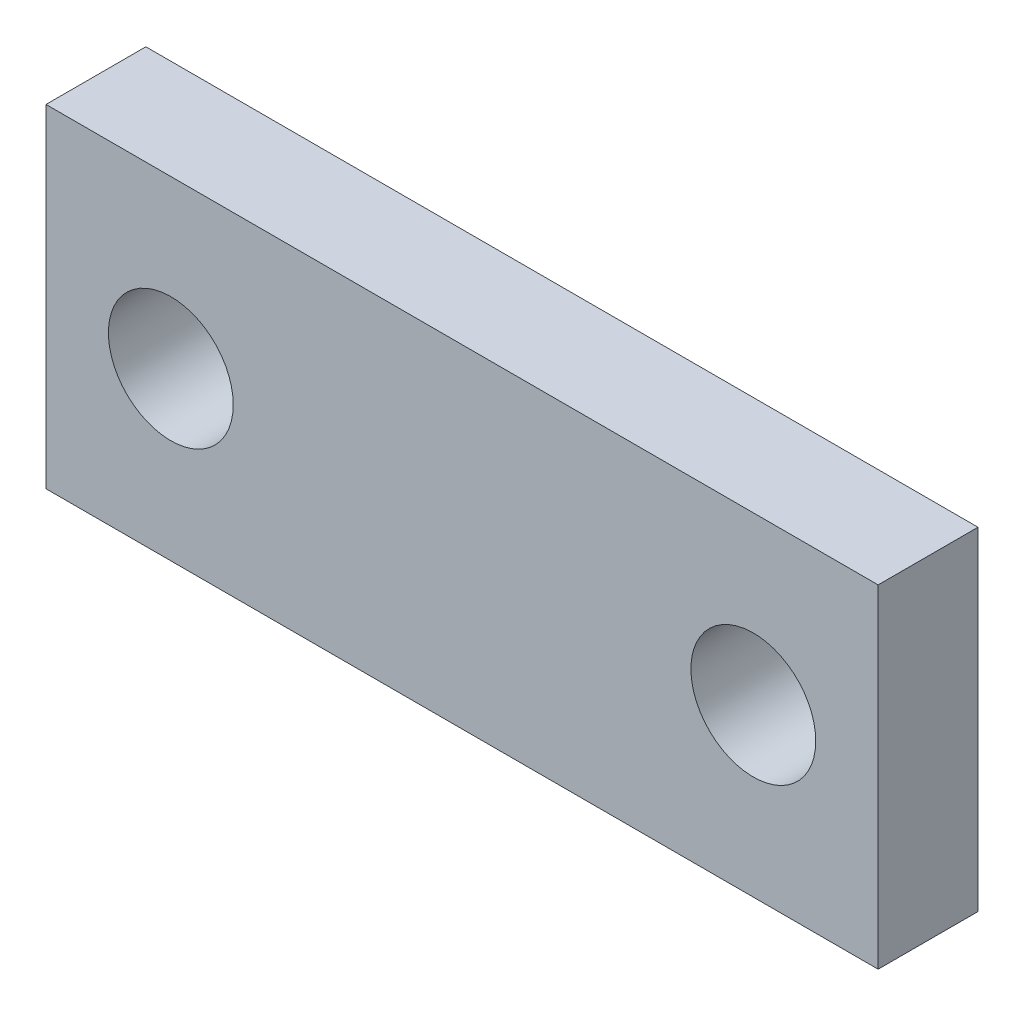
ISO-10303-21;
HEADER;
FILE_DESCRIPTION(('STEP AP214'),'2;1');
FILE_NAME('part.step','',(''),(''),'','','');
FILE_SCHEMA(('AUTOMOTIVE_DESIGN { 1 0 10303 214 1 1 1 1 }'));
ENDSEC;
DATA;
#1=APPLICATION_CONTEXT('core data for automotive mechanical design processes');
#2=APPLICATION_PROTOCOL_DEFINITION('international standard','automotive_design',2000,#1);
#3=PRODUCT_CONTEXT('',#1,'mechanical');
#4=PRODUCT('Part','Part','',(#3));
#5=PRODUCT_RELATED_PRODUCT_CATEGORY('part','',(#4));
#6=PRODUCT_DEFINITION_FORMATION('','',#4);
#7=PRODUCT_DEFINITION_CONTEXT('part definition',#1,'design');
#8=PRODUCT_DEFINITION('design','',#6,#7);
#9=PRODUCT_DEFINITION_SHAPE('','',#8);
#10=(LENGTH_UNIT() NAMED_UNIT(*) SI_UNIT(.MILLI.,.METRE.));
#11=(NAMED_UNIT(*) PLANE_ANGLE_UNIT() SI_UNIT($,.RADIAN.));
#12=(NAMED_UNIT(*) SI_UNIT($,.STERADIAN.) SOLID_ANGLE_UNIT());
#13=UNCERTAINTY_MEASURE_WITH_UNIT(LENGTH_MEASURE(1.E-05),#10,'distance_accuracy_value','');
#14=(GEOMETRIC_REPRESENTATION_CONTEXT(3) GLOBAL_UNCERTAINTY_ASSIGNED_CONTEXT((#13)) GLOBAL_UNIT_ASSIGNED_CONTEXT((#10,
#11,#12)) REPRESENTATION_CONTEXT('',''));
#15=CARTESIAN_POINT('',(0.,0.,0.));
#16=DIRECTION('',(0.,0.,1.));
#17=DIRECTION('',(1.,0.,0.));
#18=AXIS2_PLACEMENT_3D('',#15,#16,#17);
#19=CARTESIAN_POINT('',(-19.9221030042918,3.27947067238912,3.81));
#20=DIRECTION('',(1.,0.,0.));
#21=DIRECTION('',(0.,0.,-1.));
#22=AXIS2_PLACEMENT_3D('',#19,#20,#21);
#23=PLANE('',#22);
#24=DIRECTION('',(0.,-1.,0.));
#25=VECTOR('',#24,1.);
#26=CARTESIAN_POINT('',(-19.9221030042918,3.27947067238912,0.));
#27=LINE('',#26,#25);
#28=CARTESIAN_POINT('',(-19.9221030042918,3.27947067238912,0.));
#29=VERTEX_POINT('',#28);
#30=CARTESIAN_POINT('',(-19.9221030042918,-9.42052932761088,0.));
#31=VERTEX_POINT('',#30);
#32=EDGE_CURVE('E75',#29,#31,#27,.T.);
#33=ORIENTED_EDGE('',*,*,#32,.T.);
#34=DIRECTION('',(0.,0.,-1.));
#35=VECTOR('',#34,1.);
#36=CARTESIAN_POINT('',(-19.9221030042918,-9.42052932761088,3.81));
#37=LINE('',#36,#35);
#38=CARTESIAN_POINT('',(-19.9221030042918,-9.42052932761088,3.81));
#39=VERTEX_POINT('',#38);
#40=EDGE_CURVE('E11',#39,#31,#37,.T.);
#41=ORIENTED_EDGE('',*,*,#40,.F.);
#42=DIRECTION('',(0.,-1.,0.));
#43=VECTOR('',#42,1.);
#44=CARTESIAN_POINT('',(-19.9221030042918,3.27947067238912,3.81));
#45=LINE('',#44,#43);
#46=CARTESIAN_POINT('',(-19.9221030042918,3.27947067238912,3.81));
#47=VERTEX_POINT('',#46);
#48=EDGE_CURVE('E98',#47,#39,#45,.T.);
#49=ORIENTED_EDGE('',*,*,#48,.F.);
#50=DIRECTION('',(0.,0.,-1.));
#51=VECTOR('',#50,1.);
#52=CARTESIAN_POINT('',(-19.9221030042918,3.27947067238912,3.81));
#53=LINE('',#52,#51);
#54=EDGE_CURVE('E87',#47,#29,#53,.T.);
#55=ORIENTED_EDGE('',*,*,#54,.T.);
#56=EDGE_LOOP('',(#33,#41,#49,#55));
#57=FACE_BOUND('',#56,.T.);
#58=ADVANCED_FACE('F31',(#57),#23,.F.);
#59=CARTESIAN_POINT('',(-19.9221030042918,-9.42052932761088,3.81));
#60=DIRECTION('',(0.,1.,0.));
#61=DIRECTION('',(0.,0.,1.));
#62=AXIS2_PLACEMENT_3D('',#59,#60,#61);
#63=PLANE('',#62);
#64=DIRECTION('',(1.,0.,0.));
#65=VECTOR('',#64,1.);
#66=CARTESIAN_POINT('',(-19.9221030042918,-9.42052932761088,0.));
#67=LINE('',#66,#65);
#68=CARTESIAN_POINT('',(11.8278969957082,-9.42052932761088,0.));
#69=VERTEX_POINT('',#68);
#70=EDGE_CURVE('E71',#31,#69,#67,.T.);
#71=ORIENTED_EDGE('',*,*,#70,.T.);
#72=DIRECTION('',(0.,0.,-1.));
#73=VECTOR('',#72,1.);
#74=CARTESIAN_POINT('',(11.8278969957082,-9.42052932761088,3.81));
#75=LINE('',#74,#73);
#76=CARTESIAN_POINT('',(11.8278969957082,-9.42052932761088,3.81));
#77=VERTEX_POINT('',#76);
#78=EDGE_CURVE('E38',#77,#69,#75,.T.);
#79=ORIENTED_EDGE('',*,*,#78,.F.);
#80=DIRECTION('',(1.,0.,0.));
#81=VECTOR('',#80,1.);
#82=CARTESIAN_POINT('',(-19.9221030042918,-9.42052932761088,3.81));
#83=LINE('',#82,#81);
#84=EDGE_CURVE('E83',#39,#77,#83,.T.);
#85=ORIENTED_EDGE('',*,*,#84,.F.);
#86=ORIENTED_EDGE('',*,*,#40,.T.);
#87=EDGE_LOOP('',(#71,#79,#85,#86));
#88=FACE_BOUND('',#87,.T.);
#89=ADVANCED_FACE('F82',(#88),#63,.F.);
#90=CARTESIAN_POINT('',(11.8278969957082,3.27947067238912,3.81));
#91=DIRECTION('',(-1.,0.,0.));
#92=DIRECTION('',(0.,0.,1.));
#93=AXIS2_PLACEMENT_3D('',#90,#91,#92);
#94=PLANE('',#93);
#95=DIRECTION('',(0.,1.,0.));
#96=VECTOR('',#95,1.);
#97=CARTESIAN_POINT('',(11.8278969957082,3.27947067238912,0.));
#98=LINE('',#97,#96);
#99=CARTESIAN_POINT('',(11.8278969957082,3.27947067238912,0.));
#100=VERTEX_POINT('',#99);
#101=EDGE_CURVE('E76',#69,#100,#98,.T.);
#102=ORIENTED_EDGE('',*,*,#101,.T.);
#103=DIRECTION('',(0.,0.,-1.));
#104=VECTOR('',#103,1.);
#105=CARTESIAN_POINT('',(11.8278969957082,3.27947067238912,3.81));
#106=LINE('',#105,#104);
#107=CARTESIAN_POINT('',(11.8278969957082,3.27947067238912,3.81));
#108=VERTEX_POINT('',#107);
#109=EDGE_CURVE('E104',#108,#100,#106,.T.);
#110=ORIENTED_EDGE('',*,*,#109,.F.);
#111=DIRECTION('',(0.,1.,0.));
#112=VECTOR('',#111,1.);
#113=CARTESIAN_POINT('',(11.8278969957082,3.27947067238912,3.81));
#114=LINE('',#113,#112);
#115=EDGE_CURVE('E50',#77,#108,#114,.T.);
#116=ORIENTED_EDGE('',*,*,#115,.F.);
#117=ORIENTED_EDGE('',*,*,#78,.T.);
#118=EDGE_LOOP('',(#102,#110,#116,#117));
#119=FACE_BOUND('',#118,.T.);
#120=ADVANCED_FACE('F107',(#119),#94,.F.);
#121=CARTESIAN_POINT('',(-19.9221030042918,3.27947067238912,3.81));
#122=DIRECTION('',(0.,-1.,0.));
#123=DIRECTION('',(0.,0.,-1.));
#124=AXIS2_PLACEMENT_3D('',#121,#122,#123);
#125=PLANE('',#124);
#126=DIRECTION('',(-1.,0.,0.));
#127=VECTOR('',#126,1.);
#128=CARTESIAN_POINT('',(-19.9221030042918,3.27947067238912,0.));
#129=LINE('',#128,#127);
#130=EDGE_CURVE('E96',#100,#29,#129,.T.);
#131=ORIENTED_EDGE('',*,*,#130,.T.);
#132=ORIENTED_EDGE('',*,*,#54,.F.);
#133=DIRECTION('',(-1.,0.,0.));
#134=VECTOR('',#133,1.);
#135=CARTESIAN_POINT('',(-19.9221030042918,3.27947067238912,3.81));
#136=LINE('',#135,#134);
#137=EDGE_CURVE('E45',#108,#47,#136,.T.);
#138=ORIENTED_EDGE('',*,*,#137,.F.);
#139=ORIENTED_EDGE('',*,*,#109,.T.);
#140=EDGE_LOOP('',(#131,#132,#138,#139));
#141=FACE_BOUND('',#140,.T.);
#142=ADVANCED_FACE('F109',(#141),#125,.F.);
#143=CARTESIAN_POINT('',(-19.9221030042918,-9.42052932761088,3.81));
#144=DIRECTION('',(0.,0.,1.));
#145=DIRECTION('',(1.,0.,0.));
#146=AXIS2_PLACEMENT_3D('',#143,#144,#145);
#147=PLANE('',#146);
#148=CARTESIAN_POINT('',(7.06539699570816,-3.07052932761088,3.81));
#149=DIRECTION('',(0.,0.,1.));
#150=DIRECTION('',(-1.,0.,0.));
#151=AXIS2_PLACEMENT_3D('',#148,#149,#150);
#152=CIRCLE('',#151,2.38125);
#153=CARTESIAN_POINT('',(9.44664699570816,-3.07052932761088,3.81));
#154=VERTEX_POINT('',#153);
#155=EDGE_CURVE('E176',#154,#154,#152,.T.);
#156=ORIENTED_EDGE('',*,*,#155,.F.);
#157=EDGE_LOOP('',(#156));
#158=FACE_BOUND('',#157,.T.);
#159=CARTESIAN_POINT('',(-15.1596030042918,-3.07052932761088,3.81));
#160=DIRECTION('',(0.,0.,1.));
#161=DIRECTION('',(1.,0.,0.));
#162=AXIS2_PLACEMENT_3D('',#159,#160,#161);
#163=CIRCLE('',#162,2.38125);
#164=CARTESIAN_POINT('',(-12.7783530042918,-3.07052932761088,3.81));
#165=VERTEX_POINT('',#164);
#166=EDGE_CURVE('E91',#165,#165,#163,.T.);
#167=ORIENTED_EDGE('',*,*,#166,.F.);
#168=EDGE_LOOP('',(#167));
#169=FACE_BOUND('',#168,.T.);
#170=ORIENTED_EDGE('',*,*,#48,.T.);
#171=ORIENTED_EDGE('',*,*,#84,.T.);
#172=ORIENTED_EDGE('',*,*,#115,.T.);
#173=ORIENTED_EDGE('',*,*,#137,.T.);
#174=EDGE_LOOP('',(#170,#171,#172,#173));
#175=FACE_BOUND('',#174,.T.);
#176=ADVANCED_FACE('F110',(#158,#169,#175),#147,.T.);
#177=CARTESIAN_POINT('',(-19.9221030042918,-9.42052932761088,0.));
#178=DIRECTION('',(0.,0.,1.));
#179=DIRECTION('',(1.,0.,0.));
#180=AXIS2_PLACEMENT_3D('',#177,#178,#179);
#181=PLANE('',#180);
#182=CARTESIAN_POINT('',(7.06539699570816,-3.07052932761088,0.));
#183=DIRECTION('',(0.,0.,1.));
#184=DIRECTION('',(-1.,0.,0.));
#185=AXIS2_PLACEMENT_3D('',#182,#183,#184);
#186=CIRCLE('',#185,2.38125);
#187=CARTESIAN_POINT('',(9.44664699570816,-3.07052932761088,0.));
#188=VERTEX_POINT('',#187);
#189=EDGE_CURVE('E174',#188,#188,#186,.T.);
#190=ORIENTED_EDGE('',*,*,#189,.T.);
#191=EDGE_LOOP('',(#190));
#192=FACE_BOUND('',#191,.T.);
#193=CARTESIAN_POINT('',(-15.1596030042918,-3.07052932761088,0.));
#194=DIRECTION('',(0.,0.,1.));
#195=DIRECTION('',(1.,0.,0.));
#196=AXIS2_PLACEMENT_3D('',#193,#194,#195);
#197=CIRCLE('',#196,2.38125);
#198=CARTESIAN_POINT('',(-12.7783530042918,-3.07052932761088,0.));
#199=VERTEX_POINT('',#198);
#200=EDGE_CURVE('E88',#199,#199,#197,.T.);
#201=ORIENTED_EDGE('',*,*,#200,.T.);
#202=EDGE_LOOP('',(#201));
#203=FACE_BOUND('',#202,.T.);
#204=ORIENTED_EDGE('',*,*,#32,.F.);
#205=ORIENTED_EDGE('',*,*,#130,.F.);
#206=ORIENTED_EDGE('',*,*,#101,.F.);
#207=ORIENTED_EDGE('',*,*,#70,.F.);
#208=EDGE_LOOP('',(#204,#205,#206,#207));
#209=FACE_BOUND('',#208,.T.);
#210=ADVANCED_FACE('F72',(#192,#203,#209),#181,.F.);
#211=CARTESIAN_POINT('',(-15.1596030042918,-3.07052932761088,0.));
#212=DIRECTION('',(0.,0.,1.));
#213=DIRECTION('',(1.,0.,0.));
#214=AXIS2_PLACEMENT_3D('',#211,#212,#213);
#215=CYLINDRICAL_SURFACE('',#214,2.38125);
#216=CARTESIAN_POINT('',(-12.7783530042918,-3.07052932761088,0.));
#217=CARTESIAN_POINT('',(-12.7783530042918,-3.07052932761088,0.0396874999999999));
#218=CARTESIAN_POINT('',(-12.7783530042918,-3.07052932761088,0.079375));
#219=CARTESIAN_POINT('',(-12.7783530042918,-3.07052932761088,0.15875));
#220=CARTESIAN_POINT('',(-12.7783530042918,-3.07052932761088,0.1984375));
#221=CARTESIAN_POINT('',(-12.7783530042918,-3.07052932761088,0.2778125));
#222=CARTESIAN_POINT('',(-12.7783530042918,-3.07052932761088,0.3175));
#223=CARTESIAN_POINT('',(-12.7783530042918,-3.07052932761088,0.396875));
#224=CARTESIAN_POINT('',(-12.7783530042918,-3.07052932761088,0.4365625));
#225=CARTESIAN_POINT('',(-12.7783530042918,-3.07052932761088,0.5159375));
#226=CARTESIAN_POINT('',(-12.7783530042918,-3.07052932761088,0.555625));
#227=CARTESIAN_POINT('',(-12.7783530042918,-3.07052932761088,0.635));
#228=CARTESIAN_POINT('',(-12.7783530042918,-3.07052932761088,0.6746875));
#229=CARTESIAN_POINT('',(-12.7783530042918,-3.07052932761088,0.7540625));
#230=CARTESIAN_POINT('',(-12.7783530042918,-3.07052932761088,0.79375));
#231=CARTESIAN_POINT('',(-12.7783530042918,-3.07052932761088,0.873125));
#232=CARTESIAN_POINT('',(-12.7783530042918,-3.07052932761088,0.9128125));
#233=CARTESIAN_POINT('',(-12.7783530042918,-3.07052932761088,0.9921875));
#234=CARTESIAN_POINT('',(-12.7783530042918,-3.07052932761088,1.031875));
#235=CARTESIAN_POINT('',(-12.7783530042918,-3.07052932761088,1.11125));
#236=CARTESIAN_POINT('',(-12.7783530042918,-3.07052932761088,1.1509375));
#237=CARTESIAN_POINT('',(-12.7783530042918,-3.07052932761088,1.2303125));
#238=CARTESIAN_POINT('',(-12.7783530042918,-3.07052932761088,1.27));
#239=CARTESIAN_POINT('',(-12.7783530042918,-3.07052932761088,1.349375));
#240=CARTESIAN_POINT('',(-12.7783530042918,-3.07052932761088,1.3890625));
#241=CARTESIAN_POINT('',(-12.7783530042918,-3.07052932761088,1.4684375));
#242=CARTESIAN_POINT('',(-12.7783530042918,-3.07052932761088,1.508125));
#243=CARTESIAN_POINT('',(-12.7783530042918,-3.07052932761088,1.5875));
#244=CARTESIAN_POINT('',(-12.7783530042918,-3.07052932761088,1.6271875));
#245=CARTESIAN_POINT('',(-12.7783530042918,-3.07052932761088,1.7065625));
#246=CARTESIAN_POINT('',(-12.7783530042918,-3.07052932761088,1.74625));
#247=CARTESIAN_POINT('',(-12.7783530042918,-3.07052932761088,1.825625));
#248=CARTESIAN_POINT('',(-12.7783530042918,-3.07052932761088,1.8653125));
#249=CARTESIAN_POINT('',(-12.7783530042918,-3.07052932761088,1.9446875));
#250=CARTESIAN_POINT('',(-12.7783530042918,-3.07052932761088,1.984375));
#251=CARTESIAN_POINT('',(-12.7783530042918,-3.07052932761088,2.06375));
#252=CARTESIAN_POINT('',(-12.7783530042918,-3.07052932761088,2.1034375));
#253=CARTESIAN_POINT('',(-12.7783530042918,-3.07052932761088,2.1828125));
#254=CARTESIAN_POINT('',(-12.7783530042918,-3.07052932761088,2.2225));
#255=CARTESIAN_POINT('',(-12.7783530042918,-3.07052932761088,2.301875));
#256=CARTESIAN_POINT('',(-12.7783530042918,-3.07052932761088,2.3415625));
#257=CARTESIAN_POINT('',(-12.7783530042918,-3.07052932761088,2.4209375));
#258=CARTESIAN_POINT('',(-12.7783530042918,-3.07052932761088,2.460625));
#259=CARTESIAN_POINT('',(-12.7783530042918,-3.07052932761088,2.54));
#260=CARTESIAN_POINT('',(-12.7783530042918,-3.07052932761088,2.5796875));
#261=CARTESIAN_POINT('',(-12.7783530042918,-3.07052932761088,2.6590625));
#262=CARTESIAN_POINT('',(-12.7783530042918,-3.07052932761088,2.69875));
#263=CARTESIAN_POINT('',(-12.7783530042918,-3.07052932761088,2.778125));
#264=CARTESIAN_POINT('',(-12.7783530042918,-3.07052932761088,2.8178125));
#265=CARTESIAN_POINT('',(-12.7783530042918,-3.07052932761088,2.8971875));
#266=CARTESIAN_POINT('',(-12.7783530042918,-3.07052932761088,2.936875));
#267=CARTESIAN_POINT('',(-12.7783530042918,-3.07052932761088,3.01625));
#268=CARTESIAN_POINT('',(-12.7783530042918,-3.07052932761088,3.0559375));
#269=CARTESIAN_POINT('',(-12.7783530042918,-3.07052932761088,3.1353125));
#270=CARTESIAN_POINT('',(-12.7783530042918,-3.07052932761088,3.175));
#271=CARTESIAN_POINT('',(-12.7783530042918,-3.07052932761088,3.254375));
#272=CARTESIAN_POINT('',(-12.7783530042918,-3.07052932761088,3.2940625));
#273=CARTESIAN_POINT('',(-12.7783530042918,-3.07052932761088,3.3734375));
#274=CARTESIAN_POINT('',(-12.7783530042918,-3.07052932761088,3.413125));
#275=CARTESIAN_POINT('',(-12.7783530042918,-3.07052932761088,3.4925));
#276=CARTESIAN_POINT('',(-12.7783530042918,-3.07052932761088,3.5321875));
#277=CARTESIAN_POINT('',(-12.7783530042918,-3.07052932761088,3.6115625));
#278=CARTESIAN_POINT('',(-12.7783530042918,-3.07052932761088,3.65125));
#279=CARTESIAN_POINT('',(-12.7783530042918,-3.07052932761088,3.730625));
#280=CARTESIAN_POINT('',(-12.7783530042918,-3.07052932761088,3.7703125));
#281=CARTESIAN_POINT('',(-12.7783530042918,-3.07052932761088,3.81));
#282=B_SPLINE_CURVE_WITH_KNOTS('',3,(#216,#217,#218,#219,#220,#221,#222,#223,#224,#225,#226,
#227,#228,#229,#230,#231,#232,#233,#234,#235,#236,#237,#238,#239,#240,#241,#242,#243,#244,#245,
#246,#247,#248,#249,#250,#251,#252,#253,#254,#255,#256,#257,#258,#259,#260,#261,#262,#263,#264,
#265,#266,#267,#268,#269,#270,#271,#272,#273,#274,#275,#276,#277,#278,#279,#280,#281),
.UNSPECIFIED.,.F.,.F.,(4,2,2,2,2,2,2,2,2,2,2,2,2,2,2,2,2,2,2,2,2,2,2,2,2,2,2,2,2,2,2,2,4),(0.,
0.1190625,0.238125,0.3571875,0.47625,0.5953125,0.714375,0.8334375,0.9525,1.0715625,1.190625,
1.3096875,1.42875,1.5478125,1.666875,1.7859375,1.905,2.0240625,2.143125,2.2621875,2.38125,
2.5003125,2.619375,2.7384375,2.8575,2.9765625,3.095625,3.2146875,3.33375,3.4528125,3.571875,
3.6909375,3.81),.UNSPECIFIED.);
#283=EDGE_CURVE('BSEAM118',#199,#165,#282,.T.);
#284=ORIENTED_EDGE('',*,*,#200,.F.);
#285=ORIENTED_EDGE('',*,*,#166,.T.);
#286=ORIENTED_EDGE('',*,*,#283,.T.);
#287=ORIENTED_EDGE('',*,*,#283,.F.);
#288=EDGE_LOOP('',(#284,#286,#285,#287));
#289=FACE_BOUND('',#288,.T.);
#290=ADVANCED_FACE('F118',(#289),#215,.F.);
#291=CARTESIAN_POINT('',(7.06539699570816,-3.07052932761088,0.));
#292=DIRECTION('',(0.,0.,1.));
#293=DIRECTION('',(1.,0.,0.));
#294=AXIS2_PLACEMENT_3D('',#291,#292,#293);
#295=CYLINDRICAL_SURFACE('',#294,2.38125);
#296=CARTESIAN_POINT('',(9.44664699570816,-3.07052932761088,0.));
#297=CARTESIAN_POINT('',(9.44664699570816,-3.07052932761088,0.0396874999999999));
#298=CARTESIAN_POINT('',(9.44664699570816,-3.07052932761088,0.079375));
#299=CARTESIAN_POINT('',(9.44664699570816,-3.07052932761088,0.15875));
#300=CARTESIAN_POINT('',(9.44664699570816,-3.07052932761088,0.1984375));
#301=CARTESIAN_POINT('',(9.44664699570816,-3.07052932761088,0.2778125));
#302=CARTESIAN_POINT('',(9.44664699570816,-3.07052932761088,0.3175));
#303=CARTESIAN_POINT('',(9.44664699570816,-3.07052932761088,0.396875));
#304=CARTESIAN_POINT('',(9.44664699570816,-3.07052932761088,0.4365625));
#305=CARTESIAN_POINT('',(9.44664699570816,-3.07052932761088,0.5159375));
#306=CARTESIAN_POINT('',(9.44664699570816,-3.07052932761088,0.555625));
#307=CARTESIAN_POINT('',(9.44664699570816,-3.07052932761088,0.635));
#308=CARTESIAN_POINT('',(9.44664699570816,-3.07052932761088,0.6746875));
#309=CARTESIAN_POINT('',(9.44664699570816,-3.07052932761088,0.7540625));
#310=CARTESIAN_POINT('',(9.44664699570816,-3.07052932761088,0.79375));
#311=CARTESIAN_POINT('',(9.44664699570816,-3.07052932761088,0.873125));
#312=CARTESIAN_POINT('',(9.44664699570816,-3.07052932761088,0.9128125));
#313=CARTESIAN_POINT('',(9.44664699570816,-3.07052932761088,0.9921875));
#314=CARTESIAN_POINT('',(9.44664699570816,-3.07052932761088,1.031875));
#315=CARTESIAN_POINT('',(9.44664699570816,-3.07052932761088,1.11125));
#316=CARTESIAN_POINT('',(9.44664699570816,-3.07052932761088,1.1509375));
#317=CARTESIAN_POINT('',(9.44664699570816,-3.07052932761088,1.2303125));
#318=CARTESIAN_POINT('',(9.44664699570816,-3.07052932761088,1.27));
#319=CARTESIAN_POINT('',(9.44664699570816,-3.07052932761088,1.349375));
#320=CARTESIAN_POINT('',(9.44664699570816,-3.07052932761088,1.3890625));
#321=CARTESIAN_POINT('',(9.44664699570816,-3.07052932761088,1.4684375));
#322=CARTESIAN_POINT('',(9.44664699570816,-3.07052932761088,1.508125));
#323=CARTESIAN_POINT('',(9.44664699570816,-3.07052932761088,1.5875));
#324=CARTESIAN_POINT('',(9.44664699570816,-3.07052932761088,1.6271875));
#325=CARTESIAN_POINT('',(9.44664699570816,-3.07052932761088,1.7065625));
#326=CARTESIAN_POINT('',(9.44664699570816,-3.07052932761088,1.74625));
#327=CARTESIAN_POINT('',(9.44664699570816,-3.07052932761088,1.825625));
#328=CARTESIAN_POINT('',(9.44664699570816,-3.07052932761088,1.8653125));
#329=CARTESIAN_POINT('',(9.44664699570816,-3.07052932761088,1.9446875));
#330=CARTESIAN_POINT('',(9.44664699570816,-3.07052932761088,1.984375));
#331=CARTESIAN_POINT('',(9.44664699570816,-3.07052932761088,2.06375));
#332=CARTESIAN_POINT('',(9.44664699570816,-3.07052932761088,2.1034375));
#333=CARTESIAN_POINT('',(9.44664699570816,-3.07052932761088,2.1828125));
#334=CARTESIAN_POINT('',(9.44664699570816,-3.07052932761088,2.2225));
#335=CARTESIAN_POINT('',(9.44664699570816,-3.07052932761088,2.301875));
#336=CARTESIAN_POINT('',(9.44664699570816,-3.07052932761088,2.3415625));
#337=CARTESIAN_POINT('',(9.44664699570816,-3.07052932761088,2.4209375));
#338=CARTESIAN_POINT('',(9.44664699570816,-3.07052932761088,2.460625));
#339=CARTESIAN_POINT('',(9.44664699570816,-3.07052932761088,2.54));
#340=CARTESIAN_POINT('',(9.44664699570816,-3.07052932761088,2.5796875));
#341=CARTESIAN_POINT('',(9.44664699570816,-3.07052932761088,2.6590625));
#342=CARTESIAN_POINT('',(9.44664699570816,-3.07052932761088,2.69875));
#343=CARTESIAN_POINT('',(9.44664699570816,-3.07052932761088,2.778125));
#344=CARTESIAN_POINT('',(9.44664699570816,-3.07052932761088,2.8178125));
#345=CARTESIAN_POINT('',(9.44664699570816,-3.07052932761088,2.8971875));
#346=CARTESIAN_POINT('',(9.44664699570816,-3.07052932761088,2.936875));
#347=CARTESIAN_POINT('',(9.44664699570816,-3.07052932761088,3.01625));
#348=CARTESIAN_POINT('',(9.44664699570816,-3.07052932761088,3.0559375));
#349=CARTESIAN_POINT('',(9.44664699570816,-3.07052932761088,3.1353125));
#350=CARTESIAN_POINT('',(9.44664699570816,-3.07052932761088,3.175));
#351=CARTESIAN_POINT('',(9.44664699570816,-3.07052932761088,3.254375));
#352=CARTESIAN_POINT('',(9.44664699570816,-3.07052932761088,3.2940625));
#353=CARTESIAN_POINT('',(9.44664699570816,-3.07052932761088,3.3734375));
#354=CARTESIAN_POINT('',(9.44664699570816,-3.07052932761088,3.413125));
#355=CARTESIAN_POINT('',(9.44664699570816,-3.07052932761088,3.4925));
#356=CARTESIAN_POINT('',(9.44664699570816,-3.07052932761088,3.5321875));
#357=CARTESIAN_POINT('',(9.44664699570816,-3.07052932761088,3.6115625));
#358=CARTESIAN_POINT('',(9.44664699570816,-3.07052932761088,3.65125));
#359=CARTESIAN_POINT('',(9.44664699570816,-3.07052932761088,3.730625));
#360=CARTESIAN_POINT('',(9.44664699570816,-3.07052932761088,3.7703125));
#361=CARTESIAN_POINT('',(9.44664699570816,-3.07052932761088,3.81));
#362=B_SPLINE_CURVE_WITH_KNOTS('',3,(#296,#297,#298,#299,#300,#301,#302,#303,#304,#305,#306,
#307,#308,#309,#310,#311,#312,#313,#314,#315,#316,#317,#318,#319,#320,#321,#322,#323,#324,#325,
#326,#327,#328,#329,#330,#331,#332,#333,#334,#335,#336,#337,#338,#339,#340,#341,#342,#343,#344,
#345,#346,#347,#348,#349,#350,#351,#352,#353,#354,#355,#356,#357,#358,#359,#360,#361),
.UNSPECIFIED.,.F.,.F.,(4,2,2,2,2,2,2,2,2,2,2,2,2,2,2,2,2,2,2,2,2,2,2,2,2,2,2,2,2,2,2,2,4),(0.,
0.1190625,0.238125,0.3571875,0.47625,0.5953125,0.714375,0.8334375,0.9525,1.0715625,1.190625,
1.3096875,1.42875,1.5478125,1.666875,1.7859375,1.905,2.0240625,2.143125,2.2621875,2.38125,
2.5003125,2.619375,2.7384375,2.8575,2.9765625,3.095625,3.2146875,3.33375,3.4528125,3.571875,
3.6909375,3.81),.UNSPECIFIED.);
#363=EDGE_CURVE('BSEAM157',#188,#154,#362,.T.);
#364=ORIENTED_EDGE('',*,*,#189,.F.);
#365=ORIENTED_EDGE('',*,*,#155,.T.);
#366=ORIENTED_EDGE('',*,*,#363,.T.);
#367=ORIENTED_EDGE('',*,*,#363,.F.);
#368=EDGE_LOOP('',(#364,#366,#365,#367));
#369=FACE_BOUND('',#368,.T.);
#370=ADVANCED_FACE('F157',(#369),#295,.F.);
#371=CLOSED_SHELL('',(#58,#89,#120,#142,#176,#210,#290,#370));
#372=MANIFOLD_SOLID_BREP('B2',#371);
#373=ADVANCED_BREP_SHAPE_REPRESENTATION('',(#18,#372),#14);
#374=SHAPE_DEFINITION_REPRESENTATION(#9,#373);
ENDSEC;
END-ISO-10303-21;
